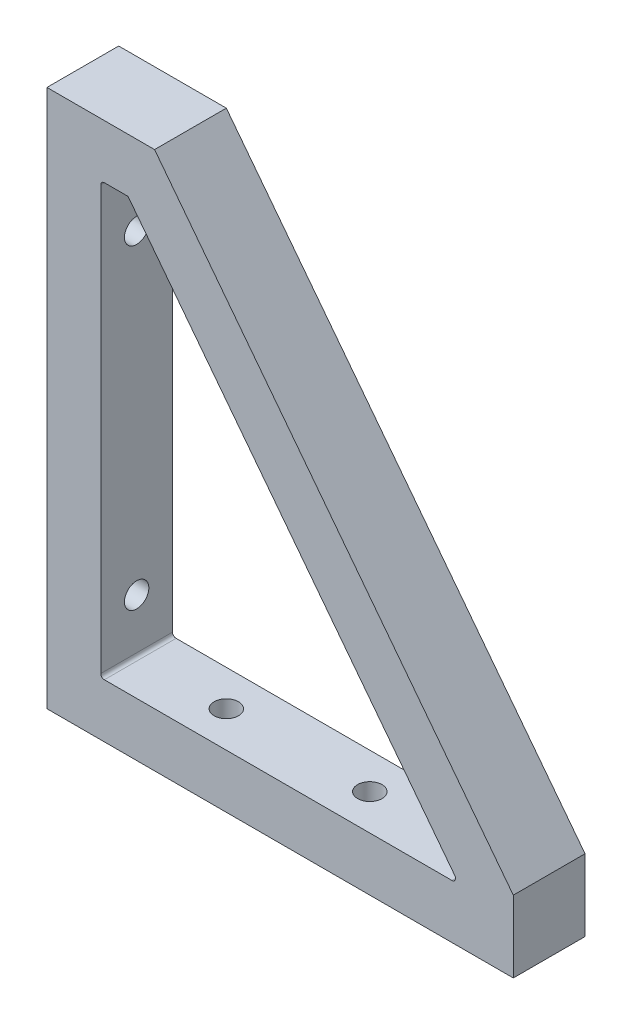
ISO-10303-21;
HEADER;
FILE_DESCRIPTION(('STEP AP214'),'2;1');
FILE_NAME('part.step','',(''),(''),'','','');
FILE_SCHEMA(('AUTOMOTIVE_DESIGN { 1 0 10303 214 1 1 1 1 }'));
ENDSEC;
DATA;
#1=APPLICATION_CONTEXT('core data for automotive mechanical design processes');
#2=APPLICATION_PROTOCOL_DEFINITION('international standard','automotive_design',2000,#1);
#3=PRODUCT_CONTEXT('',#1,'mechanical');
#4=PRODUCT('Part','Part','',(#3));
#5=PRODUCT_RELATED_PRODUCT_CATEGORY('part','',(#4));
#6=PRODUCT_DEFINITION_FORMATION('','',#4);
#7=PRODUCT_DEFINITION_CONTEXT('part definition',#1,'design');
#8=PRODUCT_DEFINITION('design','',#6,#7);
#9=PRODUCT_DEFINITION_SHAPE('','',#8);
#10=(LENGTH_UNIT() NAMED_UNIT(*) SI_UNIT(.MILLI.,.METRE.));
#11=(NAMED_UNIT(*) PLANE_ANGLE_UNIT() SI_UNIT($,.RADIAN.));
#12=(NAMED_UNIT(*) SI_UNIT($,.STERADIAN.) SOLID_ANGLE_UNIT());
#13=UNCERTAINTY_MEASURE_WITH_UNIT(LENGTH_MEASURE(1.E-05),#10,'distance_accuracy_value','');
#14=(GEOMETRIC_REPRESENTATION_CONTEXT(3) GLOBAL_UNCERTAINTY_ASSIGNED_CONTEXT((#13)) GLOBAL_UNIT_ASSIGNED_CONTEXT((#10,
#11,#12)) REPRESENTATION_CONTEXT('',''));
#15=CARTESIAN_POINT('',(0.,0.,0.));
#16=DIRECTION('',(0.,0.,1.));
#17=DIRECTION('',(1.,0.,0.));
#18=AXIS2_PLACEMENT_3D('',#15,#16,#17);
#19=CARTESIAN_POINT('',(-3.88578058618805E-13,-69.9999999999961,20.));
#20=DIRECTION('',(1.,0.,0.));
#21=DIRECTION('',(0.,1.,0.));
#22=AXIS2_PLACEMENT_3D('',#19,#20,#21);
#23=PLANE('',#22);
#24=CARTESIAN_POINT('',(-1.04759737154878E-13,-39.9999999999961,10.));
#25=DIRECTION('',(-1.,0.,0.));
#26=DIRECTION('',(0.,0.,1.));
#27=AXIS2_PLACEMENT_3D('',#24,#25,#26);
#28=CIRCLE('',#27,3.4);
#29=CARTESIAN_POINT('',(-1.04759737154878E-13,-39.9999999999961,13.4));
#30=VERTEX_POINT('',#29);
#31=EDGE_CURVE('E186',#30,#30,#28,.T.);
#32=ORIENTED_EDGE('',*,*,#31,.F.);
#33=EDGE_LOOP('',(#32));
#34=FACE_BOUND('',#33,.T.);
#35=CARTESIAN_POINT('',(1.23206057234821E-13,48.0000000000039,10.));
#36=DIRECTION('',(-1.,0.,0.));
#37=DIRECTION('',(0.,0.,1.));
#38=AXIS2_PLACEMENT_3D('',#35,#36,#37);
#39=CIRCLE('',#38,3.4);
#40=CARTESIAN_POINT('',(1.23206057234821E-13,48.0000000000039,13.4));
#41=VERTEX_POINT('',#40);
#42=EDGE_CURVE('E185',#41,#41,#39,.T.);
#43=ORIENTED_EDGE('',*,*,#42,.F.);
#44=EDGE_LOOP('',(#43));
#45=FACE_BOUND('',#44,.T.);
#46=DIRECTION('',(0.,-1.,0.));
#47=VECTOR('',#46,1.);
#48=CARTESIAN_POINT('',(-3.88578058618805E-13,-69.9999999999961,0.));
#49=LINE('',#48,#47);
#50=CARTESIAN_POINT('',(0.,80.0000000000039,0.));
#51=VERTEX_POINT('',#50);
#52=CARTESIAN_POINT('',(-3.88578058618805E-13,-69.9999999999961,0.));
#53=VERTEX_POINT('',#52);
#54=EDGE_CURVE('E124',#51,#53,#49,.T.);
#55=ORIENTED_EDGE('',*,*,#54,.T.);
#56=DIRECTION('',(0.,0.,-1.));
#57=VECTOR('',#56,1.);
#58=CARTESIAN_POINT('',(-3.88578058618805E-13,-69.9999999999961,20.));
#59=LINE('',#58,#57);
#60=CARTESIAN_POINT('',(-3.88578058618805E-13,-69.9999999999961,20.));
#61=VERTEX_POINT('',#60);
#62=EDGE_CURVE('E178',#61,#53,#59,.T.);
#63=ORIENTED_EDGE('',*,*,#62,.F.);
#64=DIRECTION('',(0.,-1.,0.));
#65=VECTOR('',#64,1.);
#66=CARTESIAN_POINT('',(-3.88578058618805E-13,-69.9999999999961,20.));
#67=LINE('',#66,#65);
#68=CARTESIAN_POINT('',(0.,80.0000000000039,20.));
#69=VERTEX_POINT('',#68);
#70=EDGE_CURVE('E145',#69,#61,#67,.T.);
#71=ORIENTED_EDGE('',*,*,#70,.F.);
#72=DIRECTION('',(0.,0.,-1.));
#73=VECTOR('',#72,1.);
#74=CARTESIAN_POINT('',(0.,80.0000000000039,20.));
#75=LINE('',#74,#73);
#76=EDGE_CURVE('E157',#69,#51,#75,.T.);
#77=ORIENTED_EDGE('',*,*,#76,.T.);
#78=EDGE_LOOP('',(#55,#63,#71,#77));
#79=FACE_BOUND('',#78,.T.);
#80=ADVANCED_FACE('F16',(#34,#45,#79),#23,.F.);
#81=CARTESIAN_POINT('',(-3.88578058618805E-13,-69.9999999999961,20.));
#82=DIRECTION('',(0.,1.,0.));
#83=DIRECTION('',(0.,0.,1.));
#84=AXIS2_PLACEMENT_3D('',#81,#82,#83);
#85=PLANE('',#84);
#86=CARTESIAN_POINT('',(40.,-69.9999999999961,10.));
#87=DIRECTION('',(0.,-1.,0.));
#88=DIRECTION('',(0.,0.,-1.));
#89=AXIS2_PLACEMENT_3D('',#86,#87,#88);
#90=CIRCLE('',#89,3.4);
#91=CARTESIAN_POINT('',(40.,-69.9999999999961,6.6));
#92=VERTEX_POINT('',#91);
#93=EDGE_CURVE('E191',#92,#92,#90,.T.);
#94=ORIENTED_EDGE('',*,*,#93,.F.);
#95=EDGE_LOOP('',(#94));
#96=FACE_BOUND('',#95,.T.);
#97=CARTESIAN_POINT('',(80.,-69.9999999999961,10.));
#98=DIRECTION('',(0.,-1.,0.));
#99=DIRECTION('',(0.,0.,-1.));
#100=AXIS2_PLACEMENT_3D('',#97,#98,#99);
#101=CIRCLE('',#100,3.4);
#102=CARTESIAN_POINT('',(80.,-69.9999999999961,6.6));
#103=VERTEX_POINT('',#102);
#104=EDGE_CURVE('E190',#103,#103,#101,.T.);
#105=ORIENTED_EDGE('',*,*,#104,.F.);
#106=EDGE_LOOP('',(#105));
#107=FACE_BOUND('',#106,.T.);
#108=DIRECTION('',(1.,0.,0.));
#109=VECTOR('',#108,1.);
#110=CARTESIAN_POINT('',(-3.88578058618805E-13,-69.9999999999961,0.));
#111=LINE('',#110,#109);
#112=CARTESIAN_POINT('',(130.,-69.9999999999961,0.));
#113=VERTEX_POINT('',#112);
#114=EDGE_CURVE('E160',#53,#113,#111,.T.);
#115=ORIENTED_EDGE('',*,*,#114,.T.);
#116=DIRECTION('',(0.,0.,-1.));
#117=VECTOR('',#116,1.);
#118=CARTESIAN_POINT('',(130.,-69.9999999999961,20.));
#119=LINE('',#118,#117);
#120=CARTESIAN_POINT('',(130.,-69.9999999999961,20.));
#121=VERTEX_POINT('',#120);
#122=EDGE_CURVE('E175',#121,#113,#119,.T.);
#123=ORIENTED_EDGE('',*,*,#122,.F.);
#124=DIRECTION('',(1.,0.,0.));
#125=VECTOR('',#124,1.);
#126=CARTESIAN_POINT('',(-3.88578058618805E-13,-69.9999999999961,20.));
#127=LINE('',#126,#125);
#128=EDGE_CURVE('E148',#61,#121,#127,.T.);
#129=ORIENTED_EDGE('',*,*,#128,.F.);
#130=ORIENTED_EDGE('',*,*,#62,.T.);
#131=EDGE_LOOP('',(#115,#123,#129,#130));
#132=FACE_BOUND('',#131,.T.);
#133=ADVANCED_FACE('F238',(#96,#107,#132),#85,.F.);
#134=CARTESIAN_POINT('',(130.,-69.9999999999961,20.));
#135=DIRECTION('',(-1.,0.,0.));
#136=DIRECTION('',(0.,0.,1.));
#137=AXIS2_PLACEMENT_3D('',#134,#135,#136);
#138=PLANE('',#137);
#139=DIRECTION('',(0.,1.,0.));
#140=VECTOR('',#139,1.);
#141=CARTESIAN_POINT('',(130.,-69.9999999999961,0.));
#142=LINE('',#141,#140);
#143=CARTESIAN_POINT('',(130.,-49.9999999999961,0.));
#144=VERTEX_POINT('',#143);
#145=EDGE_CURVE('E162',#113,#144,#142,.T.);
#146=ORIENTED_EDGE('',*,*,#145,.T.);
#147=DIRECTION('',(0.,0.,-1.));
#148=VECTOR('',#147,1.);
#149=CARTESIAN_POINT('',(130.,-49.9999999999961,20.));
#150=LINE('',#149,#148);
#151=CARTESIAN_POINT('',(130.,-49.9999999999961,20.));
#152=VERTEX_POINT('',#151);
#153=EDGE_CURVE('E172',#152,#144,#150,.T.);
#154=ORIENTED_EDGE('',*,*,#153,.F.);
#155=DIRECTION('',(0.,1.,0.));
#156=VECTOR('',#155,1.);
#157=CARTESIAN_POINT('',(130.,-69.9999999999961,20.));
#158=LINE('',#157,#156);
#159=EDGE_CURVE('E151',#121,#152,#158,.T.);
#160=ORIENTED_EDGE('',*,*,#159,.F.);
#161=ORIENTED_EDGE('',*,*,#122,.T.);
#162=EDGE_LOOP('',(#146,#154,#160,#161));
#163=FACE_BOUND('',#162,.T.);
#164=ADVANCED_FACE('F245',(#163),#138,.F.);
#165=CARTESIAN_POINT('',(130.,-49.9999999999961,20.));
#166=DIRECTION('',(-0.7926239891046,-0.609710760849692,0.));
#167=DIRECTION('',(0.609710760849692,-0.7926239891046,0.));
#168=AXIS2_PLACEMENT_3D('',#165,#166,#167);
#169=PLANE('',#168);
#170=DIRECTION('',(-0.609710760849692,0.7926239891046,0.));
#171=VECTOR('',#170,1.);
#172=CARTESIAN_POINT('',(130.,-49.9999999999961,0.));
#173=LINE('',#172,#171);
#174=CARTESIAN_POINT('',(29.9999999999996,80.0000000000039,0.));
#175=VERTEX_POINT('',#174);
#176=EDGE_CURVE('E164',#144,#175,#173,.T.);
#177=ORIENTED_EDGE('',*,*,#176,.T.);
#178=DIRECTION('',(0.,0.,-1.));
#179=VECTOR('',#178,1.);
#180=CARTESIAN_POINT('',(29.9999999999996,80.0000000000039,20.));
#181=LINE('',#180,#179);
#182=CARTESIAN_POINT('',(29.9999999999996,80.0000000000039,20.));
#183=VERTEX_POINT('',#182);
#184=EDGE_CURVE('E169',#183,#175,#181,.T.);
#185=ORIENTED_EDGE('',*,*,#184,.F.);
#186=DIRECTION('',(-0.609710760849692,0.7926239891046,0.));
#187=VECTOR('',#186,1.);
#188=CARTESIAN_POINT('',(130.,-49.9999999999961,20.));
#189=LINE('',#188,#187);
#190=EDGE_CURVE('E153',#152,#183,#189,.T.);
#191=ORIENTED_EDGE('',*,*,#190,.F.);
#192=ORIENTED_EDGE('',*,*,#153,.T.);
#193=EDGE_LOOP('',(#177,#185,#191,#192));
#194=FACE_BOUND('',#193,.T.);
#195=ADVANCED_FACE('F253',(#194),#169,.F.);
#196=CARTESIAN_POINT('',(0.,80.0000000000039,20.));
#197=DIRECTION('',(0.,-1.,0.));
#198=DIRECTION('',(0.,0.,-1.));
#199=AXIS2_PLACEMENT_3D('',#196,#197,#198);
#200=PLANE('',#199);
#201=DIRECTION('',(-1.,0.,0.));
#202=VECTOR('',#201,1.);
#203=CARTESIAN_POINT('',(0.,80.0000000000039,0.));
#204=LINE('',#203,#202);
#205=EDGE_CURVE('E149',#175,#51,#204,.T.);
#206=ORIENTED_EDGE('',*,*,#205,.T.);
#207=ORIENTED_EDGE('',*,*,#76,.F.);
#208=DIRECTION('',(-1.,0.,0.));
#209=VECTOR('',#208,1.);
#210=CARTESIAN_POINT('',(0.,80.0000000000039,20.));
#211=LINE('',#210,#209);
#212=EDGE_CURVE('E155',#183,#69,#211,.T.);
#213=ORIENTED_EDGE('',*,*,#212,.F.);
#214=ORIENTED_EDGE('',*,*,#184,.T.);
#215=EDGE_LOOP('',(#206,#207,#213,#214));
#216=FACE_BOUND('',#215,.T.);
#217=ADVANCED_FACE('F257',(#216),#200,.F.);
#218=CARTESIAN_POINT('',(0.,0.,20.));
#219=DIRECTION('',(0.,0.,-1.));
#220=DIRECTION('',(-1.,0.,0.));
#221=AXIS2_PLACEMENT_3D('',#218,#219,#220);
#222=PLANE('',#221);
#223=DIRECTION('',(0.,-1.,0.));
#224=VECTOR('',#223,1.);
#225=CARTESIAN_POINT('',(15.,65.0000000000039,20.));
#226=LINE('',#225,#224);
#227=CARTESIAN_POINT('',(15.,64.0000000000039,20.));
#228=VERTEX_POINT('',#227);
#229=CARTESIAN_POINT('',(14.9999999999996,-53.9999999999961,20.));
#230=VERTEX_POINT('',#229);
#231=EDGE_CURVE('E140',#228,#230,#226,.T.);
#232=ORIENTED_EDGE('',*,*,#231,.F.);
#233=CARTESIAN_POINT('',(16.,64.0000000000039,20.));
#234=DIRECTION('',(0.,0.,-1.));
#235=DIRECTION('',(-1.,0.,0.));
#236=AXIS2_PLACEMENT_3D('',#233,#234,#235);
#237=CIRCLE('',#236,1.);
#238=CARTESIAN_POINT('',(16.,65.0000000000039,20.));
#239=VERTEX_POINT('',#238);
#240=EDGE_CURVE('E39',#228,#239,#237,.T.);
#241=ORIENTED_EDGE('',*,*,#240,.T.);
#242=DIRECTION('',(-1.,0.,0.));
#243=VECTOR('',#242,1.);
#244=CARTESIAN_POINT('',(22.6139775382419,65.0000000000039,20.));
#245=LINE('',#244,#243);
#246=CARTESIAN_POINT('',(22.6139775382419,65.0000000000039,20.));
#247=VERTEX_POINT('',#246);
#248=EDGE_CURVE('E138',#247,#239,#245,.T.);
#249=ORIENTED_EDGE('',*,*,#248,.F.);
#250=DIRECTION('',(-0.609710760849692,0.7926239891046,0.));
#251=VECTOR('',#250,1.);
#252=CARTESIAN_POINT('',(114.921669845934,-54.9999999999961,20.));
#253=LINE('',#252,#251);
#254=CARTESIAN_POINT('',(113.683430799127,-53.3902892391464,20.));
#255=VERTEX_POINT('',#254);
#256=EDGE_CURVE('E123',#255,#247,#253,.T.);
#257=ORIENTED_EDGE('',*,*,#256,.F.);
#258=CARTESIAN_POINT('',(112.890806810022,-53.9999999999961,20.));
#259=DIRECTION('',(0.,0.,-1.));
#260=DIRECTION('',(-1.,0.,0.));
#261=AXIS2_PLACEMENT_3D('',#258,#259,#260);
#262=CIRCLE('',#261,1.);
#263=CARTESIAN_POINT('',(112.890806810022,-54.9999999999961,20.));
#264=VERTEX_POINT('',#263);
#265=EDGE_CURVE('E204',#255,#264,#262,.T.);
#266=ORIENTED_EDGE('',*,*,#265,.T.);
#267=DIRECTION('',(1.,0.,0.));
#268=VECTOR('',#267,1.);
#269=CARTESIAN_POINT('',(14.9999999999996,-54.9999999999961,20.));
#270=LINE('',#269,#268);
#271=CARTESIAN_POINT('',(15.9999999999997,-54.9999999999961,20.));
#272=VERTEX_POINT('',#271);
#273=EDGE_CURVE('E131',#272,#264,#270,.T.);
#274=ORIENTED_EDGE('',*,*,#273,.F.);
#275=CARTESIAN_POINT('',(15.9999999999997,-53.9999999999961,20.));
#276=DIRECTION('',(0.,0.,-1.));
#277=DIRECTION('',(-1.,0.,0.));
#278=AXIS2_PLACEMENT_3D('',#275,#276,#277);
#279=CIRCLE('',#278,1.);
#280=EDGE_CURVE('E24',#272,#230,#279,.T.);
#281=ORIENTED_EDGE('',*,*,#280,.T.);
#282=EDGE_LOOP('',(#232,#241,#249,#257,#266,#274,#281));
#283=FACE_BOUND('',#282,.T.);
#284=ORIENTED_EDGE('',*,*,#70,.T.);
#285=ORIENTED_EDGE('',*,*,#128,.T.);
#286=ORIENTED_EDGE('',*,*,#159,.T.);
#287=ORIENTED_EDGE('',*,*,#190,.T.);
#288=ORIENTED_EDGE('',*,*,#212,.T.);
#289=EDGE_LOOP('',(#284,#285,#286,#287,#288));
#290=FACE_BOUND('',#289,.T.);
#291=ADVANCED_FACE('F210',(#283,#290),#222,.F.);
#292=CARTESIAN_POINT('',(0.,0.,0.));
#293=DIRECTION('',(0.,0.,-1.));
#294=DIRECTION('',(-1.,0.,0.));
#295=AXIS2_PLACEMENT_3D('',#292,#293,#294);
#296=PLANE('',#295);
#297=DIRECTION('',(-1.,0.,0.));
#298=VECTOR('',#297,1.);
#299=CARTESIAN_POINT('',(22.6139775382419,65.0000000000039,0.));
#300=LINE('',#299,#298);
#301=CARTESIAN_POINT('',(22.6139775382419,65.0000000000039,0.));
#302=VERTEX_POINT('',#301);
#303=CARTESIAN_POINT('',(16.,65.0000000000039,0.));
#304=VERTEX_POINT('',#303);
#305=EDGE_CURVE('E109',#302,#304,#300,.T.);
#306=ORIENTED_EDGE('',*,*,#305,.T.);
#307=CARTESIAN_POINT('',(16.,64.0000000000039,0.));
#308=DIRECTION('',(0.,0.,-1.));
#309=DIRECTION('',(-1.,0.,0.));
#310=AXIS2_PLACEMENT_3D('',#307,#308,#309);
#311=CIRCLE('',#310,1.);
#312=CARTESIAN_POINT('',(15.,64.0000000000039,0.));
#313=VERTEX_POINT('',#312);
#314=EDGE_CURVE('E208',#304,#313,#311,.F.);
#315=ORIENTED_EDGE('',*,*,#314,.T.);
#316=DIRECTION('',(0.,-1.,0.));
#317=VECTOR('',#316,1.);
#318=CARTESIAN_POINT('',(15.,65.0000000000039,0.));
#319=LINE('',#318,#317);
#320=CARTESIAN_POINT('',(14.9999999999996,-53.9999999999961,0.));
#321=VERTEX_POINT('',#320);
#322=EDGE_CURVE('E127',#313,#321,#319,.T.);
#323=ORIENTED_EDGE('',*,*,#322,.T.);
#324=CARTESIAN_POINT('',(15.9999999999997,-53.9999999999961,0.));
#325=DIRECTION('',(0.,0.,-1.));
#326=DIRECTION('',(-1.,0.,0.));
#327=AXIS2_PLACEMENT_3D('',#324,#325,#326);
#328=CIRCLE('',#327,1.);
#329=CARTESIAN_POINT('',(15.9999999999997,-54.9999999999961,0.));
#330=VERTEX_POINT('',#329);
#331=EDGE_CURVE('E11',#321,#330,#328,.F.);
#332=ORIENTED_EDGE('',*,*,#331,.T.);
#333=DIRECTION('',(1.,0.,0.));
#334=VECTOR('',#333,1.);
#335=CARTESIAN_POINT('',(14.9999999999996,-54.9999999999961,0.));
#336=LINE('',#335,#334);
#337=CARTESIAN_POINT('',(112.890806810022,-54.9999999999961,0.));
#338=VERTEX_POINT('',#337);
#339=EDGE_CURVE('E118',#330,#338,#336,.T.);
#340=ORIENTED_EDGE('',*,*,#339,.T.);
#341=CARTESIAN_POINT('',(112.890806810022,-53.9999999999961,0.));
#342=DIRECTION('',(0.,0.,-1.));
#343=DIRECTION('',(-1.,0.,0.));
#344=AXIS2_PLACEMENT_3D('',#341,#342,#343);
#345=CIRCLE('',#344,1.);
#346=CARTESIAN_POINT('',(113.683430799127,-53.3902892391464,0.));
#347=VERTEX_POINT('',#346);
#348=EDGE_CURVE('E113',#338,#347,#345,.F.);
#349=ORIENTED_EDGE('',*,*,#348,.T.);
#350=DIRECTION('',(-0.609710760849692,0.7926239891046,0.));
#351=VECTOR('',#350,1.);
#352=CARTESIAN_POINT('',(114.921669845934,-54.9999999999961,0.));
#353=LINE('',#352,#351);
#354=EDGE_CURVE('E105',#347,#302,#353,.T.);
#355=ORIENTED_EDGE('',*,*,#354,.T.);
#356=EDGE_LOOP('',(#306,#315,#323,#332,#340,#349,#355));
#357=FACE_BOUND('',#356,.T.);
#358=ORIENTED_EDGE('',*,*,#54,.F.);
#359=ORIENTED_EDGE('',*,*,#205,.F.);
#360=ORIENTED_EDGE('',*,*,#176,.F.);
#361=ORIENTED_EDGE('',*,*,#145,.F.);
#362=ORIENTED_EDGE('',*,*,#114,.F.);
#363=EDGE_LOOP('',(#358,#359,#360,#361,#362));
#364=FACE_BOUND('',#363,.T.);
#365=ADVANCED_FACE('F107',(#357,#364),#296,.T.);
#366=CARTESIAN_POINT('',(22.6139775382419,65.0000000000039,0.));
#367=DIRECTION('',(0.,1.,0.));
#368=DIRECTION('',(0.,0.,1.));
#369=AXIS2_PLACEMENT_3D('',#366,#367,#368);
#370=PLANE('',#369);
#371=ORIENTED_EDGE('',*,*,#248,.T.);
#372=DIRECTION('',(0.,0.,1.));
#373=VECTOR('',#372,1.);
#374=CARTESIAN_POINT('',(16.,65.0000000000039,0.));
#375=LINE('',#374,#373);
#376=EDGE_CURVE('E31',#239,#304,#375,.F.);
#377=ORIENTED_EDGE('',*,*,#376,.T.);
#378=ORIENTED_EDGE('',*,*,#305,.F.);
#379=DIRECTION('',(0.,0.,1.));
#380=VECTOR('',#379,1.);
#381=CARTESIAN_POINT('',(22.6139775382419,65.0000000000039,0.));
#382=LINE('',#381,#380);
#383=EDGE_CURVE('E117',#302,#247,#382,.T.);
#384=ORIENTED_EDGE('',*,*,#383,.T.);
#385=EDGE_LOOP('',(#371,#377,#378,#384));
#386=FACE_BOUND('',#385,.T.);
#387=ADVANCED_FACE('F126',(#386),#370,.F.);
#388=CARTESIAN_POINT('',(114.921669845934,-54.9999999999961,0.));
#389=DIRECTION('',(0.7926239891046,0.609710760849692,0.));
#390=DIRECTION('',(-0.609710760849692,0.7926239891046,0.));
#391=AXIS2_PLACEMENT_3D('',#388,#389,#390);
#392=PLANE('',#391);
#393=ORIENTED_EDGE('',*,*,#354,.F.);
#394=DIRECTION('',(0.,0.,1.));
#395=VECTOR('',#394,1.);
#396=CARTESIAN_POINT('',(113.683430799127,-53.3902892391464,20.));
#397=LINE('',#396,#395);
#398=EDGE_CURVE('E181',#347,#255,#397,.T.);
#399=ORIENTED_EDGE('',*,*,#398,.T.);
#400=ORIENTED_EDGE('',*,*,#256,.T.);
#401=ORIENTED_EDGE('',*,*,#383,.F.);
#402=EDGE_LOOP('',(#393,#399,#400,#401));
#403=FACE_BOUND('',#402,.T.);
#404=ADVANCED_FACE('F121',(#403),#392,.F.);
#405=CARTESIAN_POINT('',(14.9999999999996,-54.9999999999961,0.));
#406=DIRECTION('',(0.,-1.,0.));
#407=DIRECTION('',(0.,0.,-1.));
#408=AXIS2_PLACEMENT_3D('',#405,#406,#407);
#409=PLANE('',#408);
#410=CARTESIAN_POINT('',(40.,-54.9999999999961,10.));
#411=DIRECTION('',(0.,-1.,0.));
#412=DIRECTION('',(0.,0.,-1.));
#413=AXIS2_PLACEMENT_3D('',#410,#411,#412);
#414=CIRCLE('',#413,3.4);
#415=CARTESIAN_POINT('',(40.,-54.9999999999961,6.6));
#416=VERTEX_POINT('',#415);
#417=EDGE_CURVE('E187',#416,#416,#414,.T.);
#418=ORIENTED_EDGE('',*,*,#417,.T.);
#419=EDGE_LOOP('',(#418));
#420=FACE_BOUND('',#419,.T.);
#421=CARTESIAN_POINT('',(80.,-54.9999999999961,10.));
#422=DIRECTION('',(0.,-1.,0.));
#423=DIRECTION('',(0.,0.,-1.));
#424=AXIS2_PLACEMENT_3D('',#421,#422,#423);
#425=CIRCLE('',#424,3.4);
#426=CARTESIAN_POINT('',(80.,-54.9999999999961,6.6));
#427=VERTEX_POINT('',#426);
#428=EDGE_CURVE('E300',#427,#427,#425,.T.);
#429=ORIENTED_EDGE('',*,*,#428,.T.);
#430=EDGE_LOOP('',(#429));
#431=FACE_BOUND('',#430,.T.);
#432=ORIENTED_EDGE('',*,*,#273,.T.);
#433=DIRECTION('',(0.,0.,1.));
#434=VECTOR('',#433,1.);
#435=CARTESIAN_POINT('',(112.890806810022,-54.9999999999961,0.));
#436=LINE('',#435,#434);
#437=EDGE_CURVE('E196',#264,#338,#436,.F.);
#438=ORIENTED_EDGE('',*,*,#437,.T.);
#439=ORIENTED_EDGE('',*,*,#339,.F.);
#440=DIRECTION('',(0.,0.,1.));
#441=VECTOR('',#440,1.);
#442=CARTESIAN_POINT('',(15.9999999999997,-54.9999999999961,20.));
#443=LINE('',#442,#441);
#444=EDGE_CURVE('E193',#330,#272,#443,.T.);
#445=ORIENTED_EDGE('',*,*,#444,.T.);
#446=EDGE_LOOP('',(#432,#438,#439,#445));
#447=FACE_BOUND('',#446,.T.);
#448=ADVANCED_FACE('F222',(#420,#431,#447),#409,.F.);
#449=CARTESIAN_POINT('',(15.,65.0000000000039,0.));
#450=DIRECTION('',(-1.,0.,0.));
#451=DIRECTION('',(0.,-1.,0.));
#452=AXIS2_PLACEMENT_3D('',#449,#450,#451);
#453=PLANE('',#452);
#454=CARTESIAN_POINT('',(14.9999999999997,-39.9999999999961,10.));
#455=DIRECTION('',(-1.,0.,0.));
#456=DIRECTION('',(0.,-1.,0.));
#457=AXIS2_PLACEMENT_3D('',#454,#455,#456);
#458=CIRCLE('',#457,3.4);
#459=CARTESIAN_POINT('',(14.9999999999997,-43.3999999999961,10.));
#460=VERTEX_POINT('',#459);
#461=EDGE_CURVE('E182',#460,#460,#458,.T.);
#462=ORIENTED_EDGE('',*,*,#461,.T.);
#463=EDGE_LOOP('',(#462));
#464=FACE_BOUND('',#463,.T.);
#465=CARTESIAN_POINT('',(15.,48.0000000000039,10.));
#466=DIRECTION('',(-1.,0.,0.));
#467=DIRECTION('',(0.,-1.,0.));
#468=AXIS2_PLACEMENT_3D('',#465,#466,#467);
#469=CIRCLE('',#468,3.4);
#470=CARTESIAN_POINT('',(15.,44.6000000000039,10.));
#471=VERTEX_POINT('',#470);
#472=EDGE_CURVE('E134',#471,#471,#469,.T.);
#473=ORIENTED_EDGE('',*,*,#472,.T.);
#474=EDGE_LOOP('',(#473));
#475=FACE_BOUND('',#474,.T.);
#476=ORIENTED_EDGE('',*,*,#322,.F.);
#477=DIRECTION('',(0.,0.,1.));
#478=VECTOR('',#477,1.);
#479=CARTESIAN_POINT('',(15.,64.0000000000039,20.));
#480=LINE('',#479,#478);
#481=EDGE_CURVE('E200',#313,#228,#480,.T.);
#482=ORIENTED_EDGE('',*,*,#481,.T.);
#483=ORIENTED_EDGE('',*,*,#231,.T.);
#484=DIRECTION('',(0.,0.,1.));
#485=VECTOR('',#484,1.);
#486=CARTESIAN_POINT('',(14.9999999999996,-53.9999999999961,0.));
#487=LINE('',#486,#485);
#488=EDGE_CURVE('E198',#230,#321,#487,.F.);
#489=ORIENTED_EDGE('',*,*,#488,.T.);
#490=EDGE_LOOP('',(#476,#482,#483,#489));
#491=FACE_BOUND('',#490,.T.);
#492=ADVANCED_FACE('F217',(#464,#475,#491),#453,.F.);
#493=CARTESIAN_POINT('',(1.24344978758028E-13,48.0000000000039,10.));
#494=DIRECTION('',(-1.,0.,0.));
#495=DIRECTION('',(0.,0.,1.));
#496=AXIS2_PLACEMENT_3D('',#493,#494,#495);
#497=CYLINDRICAL_SURFACE('',#496,3.4);
#498=ORIENTED_EDGE('',*,*,#42,.T.);
#499=EDGE_LOOP('',(#498));
#500=FACE_BOUND('',#499,.T.);
#501=ORIENTED_EDGE('',*,*,#472,.F.);
#502=EDGE_LOOP('',(#501));
#503=FACE_BOUND('',#502,.T.);
#504=ADVANCED_FACE('F270',(#500,#503),#497,.F.);
#505=CARTESIAN_POINT('',(-1.03620815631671E-13,-39.9999999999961,10.));
#506=DIRECTION('',(-1.,0.,0.));
#507=DIRECTION('',(0.,0.,1.));
#508=AXIS2_PLACEMENT_3D('',#505,#506,#507);
#509=CYLINDRICAL_SURFACE('',#508,3.4);
#510=ORIENTED_EDGE('',*,*,#31,.T.);
#511=EDGE_LOOP('',(#510));
#512=FACE_BOUND('',#511,.T.);
#513=ORIENTED_EDGE('',*,*,#461,.F.);
#514=EDGE_LOOP('',(#513));
#515=FACE_BOUND('',#514,.T.);
#516=ADVANCED_FACE('F279',(#512,#515),#509,.F.);
#517=CARTESIAN_POINT('',(80.,-69.9999999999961,10.));
#518=DIRECTION('',(0.,-1.,0.));
#519=DIRECTION('',(0.,0.,-1.));
#520=AXIS2_PLACEMENT_3D('',#517,#518,#519);
#521=CYLINDRICAL_SURFACE('',#520,3.4);
#522=ORIENTED_EDGE('',*,*,#104,.T.);
#523=EDGE_LOOP('',(#522));
#524=FACE_BOUND('',#523,.T.);
#525=ORIENTED_EDGE('',*,*,#428,.F.);
#526=EDGE_LOOP('',(#525));
#527=FACE_BOUND('',#526,.T.);
#528=ADVANCED_FACE('F283',(#524,#527),#521,.F.);
#529=CARTESIAN_POINT('',(40.,-69.9999999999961,10.));
#530=DIRECTION('',(0.,-1.,0.));
#531=DIRECTION('',(0.,0.,-1.));
#532=AXIS2_PLACEMENT_3D('',#529,#530,#531);
#533=CYLINDRICAL_SURFACE('',#532,3.4);
#534=ORIENTED_EDGE('',*,*,#93,.T.);
#535=EDGE_LOOP('',(#534));
#536=FACE_BOUND('',#535,.T.);
#537=ORIENTED_EDGE('',*,*,#417,.F.);
#538=EDGE_LOOP('',(#537));
#539=FACE_BOUND('',#538,.T.);
#540=ADVANCED_FACE('F235',(#536,#539),#533,.F.);
#541=CARTESIAN_POINT('',(112.890806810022,-53.9999999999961,0.));
#542=DIRECTION('',(0.,0.,-1.));
#543=DIRECTION('',(-1.,0.,0.));
#544=AXIS2_PLACEMENT_3D('',#541,#542,#543);
#545=CYLINDRICAL_SURFACE('',#544,1.);
#546=ORIENTED_EDGE('',*,*,#348,.F.);
#547=ORIENTED_EDGE('',*,*,#437,.F.);
#548=ORIENTED_EDGE('',*,*,#265,.F.);
#549=ORIENTED_EDGE('',*,*,#398,.F.);
#550=EDGE_LOOP('',(#546,#547,#548,#549));
#551=FACE_BOUND('',#550,.T.);
#552=ADVANCED_FACE('F225',(#551),#545,.F.);
#553=CARTESIAN_POINT('',(16.,64.0000000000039,0.));
#554=DIRECTION('',(0.,0.,-1.));
#555=DIRECTION('',(-1.,0.,0.));
#556=AXIS2_PLACEMENT_3D('',#553,#554,#555);
#557=CYLINDRICAL_SURFACE('',#556,1.);
#558=ORIENTED_EDGE('',*,*,#314,.F.);
#559=ORIENTED_EDGE('',*,*,#376,.F.);
#560=ORIENTED_EDGE('',*,*,#240,.F.);
#561=ORIENTED_EDGE('',*,*,#481,.F.);
#562=EDGE_LOOP('',(#558,#559,#560,#561));
#563=FACE_BOUND('',#562,.T.);
#564=ADVANCED_FACE('F227',(#563),#557,.F.);
#565=CARTESIAN_POINT('',(15.9999999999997,-53.9999999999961,0.));
#566=DIRECTION('',(0.,0.,-1.));
#567=DIRECTION('',(-1.,0.,0.));
#568=AXIS2_PLACEMENT_3D('',#565,#566,#567);
#569=CYLINDRICAL_SURFACE('',#568,1.);
#570=ORIENTED_EDGE('',*,*,#331,.F.);
#571=ORIENTED_EDGE('',*,*,#488,.F.);
#572=ORIENTED_EDGE('',*,*,#280,.F.);
#573=ORIENTED_EDGE('',*,*,#444,.F.);
#574=EDGE_LOOP('',(#570,#571,#572,#573));
#575=FACE_BOUND('',#574,.T.);
#576=ADVANCED_FACE('F18',(#575),#569,.F.);
#577=CLOSED_SHELL('',(#80,#133,#164,#195,#217,#291,#365,#387,#404,#448,#492,#504,#516,#528,#540,
#552,#564,#576));
#578=MANIFOLD_SOLID_BREP('B1',#577);
#579=ADVANCED_BREP_SHAPE_REPRESENTATION('',(#18,#578),#14);
#580=SHAPE_DEFINITION_REPRESENTATION(#9,#579);
ENDSEC;
END-ISO-10303-21;
